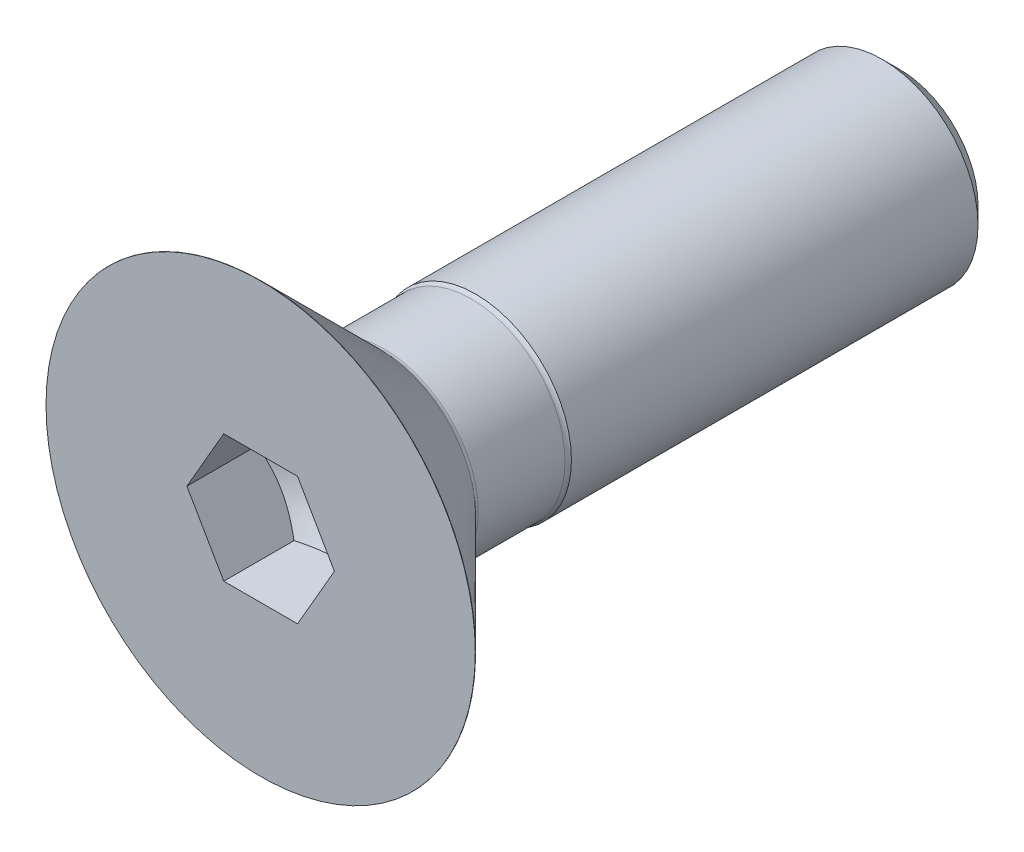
ISO-10303-21;
HEADER;
FILE_DESCRIPTION(('STEP AP214'),'2;1');
FILE_NAME('part.step','',(''),(''),'','','');
FILE_SCHEMA(('AUTOMOTIVE_DESIGN { 1 0 10303 214 1 1 1 1 }'));
ENDSEC;
DATA;
#1=APPLICATION_CONTEXT('core data for automotive mechanical design processes');
#2=APPLICATION_PROTOCOL_DEFINITION('international standard','automotive_design',2000,#1);
#3=PRODUCT_CONTEXT('',#1,'mechanical');
#4=PRODUCT('Part','Part','',(#3));
#5=PRODUCT_RELATED_PRODUCT_CATEGORY('part','',(#4));
#6=PRODUCT_DEFINITION_FORMATION('','',#4);
#7=PRODUCT_DEFINITION_CONTEXT('part definition',#1,'design');
#8=PRODUCT_DEFINITION('design','',#6,#7);
#9=PRODUCT_DEFINITION_SHAPE('','',#8);
#10=(LENGTH_UNIT() NAMED_UNIT(*) SI_UNIT(.MILLI.,.METRE.));
#11=(NAMED_UNIT(*) PLANE_ANGLE_UNIT() SI_UNIT($,.RADIAN.));
#12=(NAMED_UNIT(*) SI_UNIT($,.STERADIAN.) SOLID_ANGLE_UNIT());
#13=UNCERTAINTY_MEASURE_WITH_UNIT(LENGTH_MEASURE(1.E-05),#10,'distance_accuracy_value','');
#14=(GEOMETRIC_REPRESENTATION_CONTEXT(3) GLOBAL_UNCERTAINTY_ASSIGNED_CONTEXT((#13)) GLOBAL_UNIT_ASSIGNED_CONTEXT((#10,
#11,#12)) REPRESENTATION_CONTEXT('',''));
#15=CARTESIAN_POINT('',(0.,0.,0.));
#16=DIRECTION('',(0.,0.,1.));
#17=DIRECTION('',(1.,0.,0.));
#18=AXIS2_PLACEMENT_3D('',#15,#16,#17);
#19=CARTESIAN_POINT('',(0.,1.229375,-20.));
#20=DIRECTION('',(0.,0.,-1.));
#21=DIRECTION('',(-1.,0.,0.));
#22=AXIS2_PLACEMENT_3D('',#19,#20,#21);
#23=PLANE('',#22);
#24=CARTESIAN_POINT('',(0.,0.,-20.0000000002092));
#25=DIRECTION('',(0.,0.,1.));
#26=DIRECTION('',(1.,0.,0.));
#27=AXIS2_PLACEMENT_3D('',#24,#25,#26);
#28=CIRCLE('',#27,2.45875000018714);
#29=CARTESIAN_POINT('',(2.45875000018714,0.,-20.0000000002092));
#30=VERTEX_POINT('',#29);
#31=EDGE_CURVE('E20',#30,#30,#28,.T.);
#32=ORIENTED_EDGE('',*,*,#31,.F.);
#33=EDGE_LOOP('',(#32));
#34=FACE_BOUND('',#33,.T.);
#35=ADVANCED_FACE('F16',(#34),#23,.T.);
#36=CARTESIAN_POINT('',(0.,0.,-19.4587499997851));
#37=DIRECTION('',(0.,0.,1.));
#38=DIRECTION('',(1.,0.,0.));
#39=AXIS2_PLACEMENT_3D('',#36,#37,#38);
#40=CONICAL_SURFACE('',#39,2.99999999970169,0.785398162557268);
#41=ORIENTED_EDGE('',*,*,#31,.T.);
#42=EDGE_LOOP('',(#41));
#43=FACE_BOUND('',#42,.T.);
#44=CARTESIAN_POINT('',(0.,0.,-19.45875));
#45=DIRECTION('',(0.,0.,-1.));
#46=DIRECTION('',(-1.,0.,0.));
#47=AXIS2_PLACEMENT_3D('',#44,#45,#46);
#48=CIRCLE('',#47,3.);
#49=CARTESIAN_POINT('',(-3.,0.,-19.45875));
#50=VERTEX_POINT('',#49);
#51=EDGE_CURVE('E158',#50,#50,#48,.F.);
#52=ORIENTED_EDGE('',*,*,#51,.F.);
#53=EDGE_LOOP('',(#52));
#54=FACE_BOUND('',#53,.T.);
#55=ADVANCED_FACE('F238',(#43,#54),#40,.T.);
#56=CARTESIAN_POINT('',(0.,0.,-13.094375));
#57=DIRECTION('',(0.,0.,-1.));
#58=DIRECTION('',(-1.,0.,0.));
#59=AXIS2_PLACEMENT_3D('',#56,#57,#58);
#60=CYLINDRICAL_SURFACE('',#59,3.);
#61=ORIENTED_EDGE('',*,*,#51,.T.);
#62=EDGE_LOOP('',(#61));
#63=FACE_BOUND('',#62,.T.);
#64=CARTESIAN_POINT('',(0.,0.,-6.73));
#65=DIRECTION('',(0.,0.,1.));
#66=DIRECTION('',(0.,-1.,0.));
#67=AXIS2_PLACEMENT_3D('',#64,#65,#66);
#68=CIRCLE('',#67,3.);
#69=CARTESIAN_POINT('',(0.,-3.,-6.73));
#70=VERTEX_POINT('',#69);
#71=EDGE_CURVE('E155',#70,#70,#68,.T.);
#72=ORIENTED_EDGE('',*,*,#71,.F.);
#73=EDGE_LOOP('',(#72));
#74=FACE_BOUND('',#73,.T.);
#75=ADVANCED_FACE('F232',(#63,#74),#60,.T.);
#76=CARTESIAN_POINT('',(0.,0.,-6.58857864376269));
#77=DIRECTION('',(0.,0.,-1.));
#78=DIRECTION('',(0.,1.,0.));
#79=AXIS2_PLACEMENT_3D('',#76,#77,#78);
#80=TOROIDAL_SURFACE('',#79,3.14142135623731,0.200000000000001);
#81=ORIENTED_EDGE('',*,*,#71,.T.);
#82=EDGE_LOOP('',(#81));
#83=FACE_BOUND('',#82,.T.);
#84=CARTESIAN_POINT('',(0.,0.,-6.58857864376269));
#85=DIRECTION('',(0.,0.,-1.));
#86=DIRECTION('',(-1.,0.,0.));
#87=AXIS2_PLACEMENT_3D('',#84,#85,#86);
#88=CIRCLE('',#87,2.94142135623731);
#89=CARTESIAN_POINT('',(-2.94142135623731,0.,-6.58857864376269));
#90=VERTEX_POINT('',#89);
#91=EDGE_CURVE('E152',#90,#90,#88,.F.);
#92=ORIENTED_EDGE('',*,*,#91,.F.);
#93=EDGE_LOOP('',(#92));
#94=FACE_BOUND('',#93,.T.);
#95=ADVANCED_FACE('F230',(#83,#94),#80,.F.);
#96=CARTESIAN_POINT('',(0.,0.,-5.23));
#97=DIRECTION('',(0.,0.,-1.));
#98=DIRECTION('',(-1.,0.,0.));
#99=AXIS2_PLACEMENT_3D('',#96,#97,#98);
#100=CYLINDRICAL_SURFACE('',#99,2.94142135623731);
#101=CARTESIAN_POINT('',(0.,0.,-3.87142135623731));
#102=DIRECTION('',(0.,0.,1.));
#103=DIRECTION('',(0.,-1.,0.));
#104=AXIS2_PLACEMENT_3D('',#101,#102,#103);
#105=CIRCLE('',#104,2.94142135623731);
#106=CARTESIAN_POINT('',(0.,-2.94142135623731,-3.87142135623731));
#107=VERTEX_POINT('',#106);
#108=EDGE_CURVE('E149',#107,#107,#105,.T.);
#109=ORIENTED_EDGE('',*,*,#108,.F.);
#110=EDGE_LOOP('',(#109));
#111=FACE_BOUND('',#110,.T.);
#112=ORIENTED_EDGE('',*,*,#91,.T.);
#113=EDGE_LOOP('',(#112));
#114=FACE_BOUND('',#113,.T.);
#115=ADVANCED_FACE('F231',(#111,#114),#100,.T.);
#116=CARTESIAN_POINT('',(0.,0.,-3.87142135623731));
#117=DIRECTION('',(0.,0.,-1.));
#118=DIRECTION('',(0.,1.,0.));
#119=AXIS2_PLACEMENT_3D('',#116,#117,#118);
#120=TOROIDAL_SURFACE('',#119,3.14142135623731,0.200000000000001);
#121=CARTESIAN_POINT('',(0.,0.,-3.73000000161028));
#122=DIRECTION('',(0.,0.,1.));
#123=DIRECTION('',(0.,1.,0.));
#124=AXIS2_PLACEMENT_3D('',#121,#122,#123);
#125=CIRCLE('',#124,3.00000000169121);
#126=CARTESIAN_POINT('',(0.,3.00000000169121,-3.73000000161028));
#127=VERTEX_POINT('',#126);
#128=EDGE_CURVE('E146',#127,#127,#125,.T.);
#129=ORIENTED_EDGE('',*,*,#128,.F.);
#130=EDGE_LOOP('',(#129));
#131=FACE_BOUND('',#130,.T.);
#132=ORIENTED_EDGE('',*,*,#108,.T.);
#133=EDGE_LOOP('',(#132));
#134=FACE_BOUND('',#133,.T.);
#135=ADVANCED_FACE('F18',(#131,#134),#120,.F.);
#136=CARTESIAN_POINT('',(0.,0.,-0.00999999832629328));
#137=DIRECTION('',(0.,0.,1.));
#138=DIRECTION('',(1.,0.,0.));
#139=AXIS2_PLACEMENT_3D('',#136,#137,#138);
#140=CONICAL_SURFACE('',#139,6.71999999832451,0.78539816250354);
#141=ORIENTED_EDGE('',*,*,#128,.T.);
#142=EDGE_LOOP('',(#141));
#143=FACE_BOUND('',#142,.T.);
#144=CARTESIAN_POINT('',(0.,0.,-0.01));
#145=DIRECTION('',(0.,0.,-1.));
#146=DIRECTION('',(-1.,0.,0.));
#147=AXIS2_PLACEMENT_3D('',#144,#145,#146);
#148=CIRCLE('',#147,6.72);
#149=CARTESIAN_POINT('',(-6.72,0.,-0.0100000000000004));
#150=VERTEX_POINT('',#149);
#151=EDGE_CURVE('E80',#150,#150,#148,.F.);
#152=ORIENTED_EDGE('',*,*,#151,.F.);
#153=EDGE_LOOP('',(#152));
#154=FACE_BOUND('',#153,.T.);
#155=ADVANCED_FACE('F182',(#143,#154),#140,.T.);
#156=CARTESIAN_POINT('',(0.,0.,-2.19200000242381));
#157=DIRECTION('',(0.,0.,1.));
#158=DIRECTION('',(1.,0.,0.));
#159=AXIS2_PLACEMENT_3D('',#156,#157,#158);
#160=CONICAL_SURFACE('',#159,2.32325639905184,1.04719754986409);
#161=CARTESIAN_POINT('',(1.1546999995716,1.99999906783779,-2.19999999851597));
#162=CARTESIAN_POINT('',(1.05991057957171,1.99999906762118,-2.22736621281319));
#163=CARTESIAN_POINT('',(0.964371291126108,1.99999906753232,-2.25242075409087));
#164=CARTESIAN_POINT('',(0.771740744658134,1.99999906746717,-2.29670154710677));
#165=CARTESIAN_POINT('',(0.674646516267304,1.99999906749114,-2.315914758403));
#166=CARTESIAN_POINT('',(0.481547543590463,1.99999906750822,-2.34681192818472));
#167=CARTESIAN_POINT('',(0.385569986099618,1.99999906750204,-2.35866061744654));
#168=CARTESIAN_POINT('',(0.19306114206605,1.99999906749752,-2.37456678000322));
#169=CARTESIAN_POINT('',(0.0965305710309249,1.99999906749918,-2.37863271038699));
#170=CARTESIAN_POINT('',(-0.0965305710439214,1.99999906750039,-2.37863271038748));
#171=CARTESIAN_POINT('',(-0.193061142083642,1.99999906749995,-2.37456678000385));
#172=CARTESIAN_POINT('',(-0.38556998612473,1.99999906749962,-2.35866061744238));
#173=CARTESIAN_POINT('',(-0.481547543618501,1.99999906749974,-2.34681192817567));
#174=CARTESIAN_POINT('',(-0.674646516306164,1.99999906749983,-2.31591475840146));
#175=CARTESIAN_POINT('',(-0.771740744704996,1.99999906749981,-2.29670154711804));
#176=CARTESIAN_POINT('',(-0.964371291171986,1.99999906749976,-2.25242075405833));
#177=CARTESIAN_POINT('',(-1.05991057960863,1.99999906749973,-2.22736621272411));
#178=CARTESIAN_POINT('',(-1.15469999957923,1.99999906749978,-2.19999999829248));
#179=B_SPLINE_CURVE_WITH_KNOTS('',3,(#161,#162,#163,#164,#165,#166,#167,#168,#169,#170,#171,
#172,#173,#174,#175,#176,#177,#178),.UNSPECIFIED.,.F.,.F.,(4,2,2,2,2,2,2,2,4),(0.,
0.296073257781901,0.592802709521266,0.882630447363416,1.17214306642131,1.46165568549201,
1.75148342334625,2.048212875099,2.34428613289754),.UNSPECIFIED.);
#180=CARTESIAN_POINT('',(1.15469999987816,1.99999906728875,-2.1999999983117));
#181=VERTEX_POINT('',#180);
#182=CARTESIAN_POINT('',(-1.15469999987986,1.99999906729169,-2.19999999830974));
#183=VERTEX_POINT('',#182);
#184=EDGE_CURVE('E105',#181,#183,#179,.T.);
#185=ORIENTED_EDGE('',*,*,#184,.T.);
#186=CARTESIAN_POINT('',(-1.15470000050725,1.99999906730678,-2.1999999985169));
#187=CARTESIAN_POINT('',(-1.20544207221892,1.91211122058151,-2.22930443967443));
#188=CARTESIAN_POINT('',(-1.25662214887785,1.82346472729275,-2.25595529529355));
#189=CARTESIAN_POINT('',(-1.35986845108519,1.64463688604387,-2.30247356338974));
#190=CARTESIAN_POINT('',(-1.41193651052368,1.55445236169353,-2.32232452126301));
#191=CARTESIAN_POINT('',(-1.51542737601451,1.37520092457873,-2.35322396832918));
#192=CARTESIAN_POINT('',(-1.56683426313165,1.28616158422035,-2.36447813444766));
#193=CARTESIAN_POINT('',(-1.66988979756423,1.10766416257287,-2.37791074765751));
#194=CARTESIAN_POINT('',(-1.72153807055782,1.01820672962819,-2.38010032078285));
#195=CARTESIAN_POINT('',(-1.81803732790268,0.851065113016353,-2.37553362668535));
#196=CARTESIAN_POINT('',(-1.8629027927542,0.773355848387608,-2.36989863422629));
#197=CARTESIAN_POINT('',(-1.9523414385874,0.61844356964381,-2.35204262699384));
#198=CARTESIAN_POINT('',(-1.99691431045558,0.541241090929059,-2.33981551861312));
#199=CARTESIAN_POINT('',(-2.08653720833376,0.386009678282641,-2.30925011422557));
#200=CARTESIAN_POINT('',(-2.13157589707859,0.30800038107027,-2.29078231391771));
#201=CARTESIAN_POINT('',(-2.22098171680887,0.153144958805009,-2.24886821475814));
#202=CARTESIAN_POINT('',(-2.26534999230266,0.076296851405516,-2.22543175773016));
#203=CARTESIAN_POINT('',(-2.30939999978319,3.75516597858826E-10,-2.19999999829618));
#204=B_SPLINE_CURVE_WITH_KNOTS('',3,(#186,#187,#188,#189,#190,#191,#192,#193,#194,#195,#196,
#197,#198,#199,#200,#201,#202,#203),.UNSPECIFIED.,.F.,.F.,(4,2,2,2,2,2,2,2,4),(0.,
0.31701586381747,0.634793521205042,0.944707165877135,1.25424030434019,1.52370707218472,
1.79342335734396,2.06912065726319,2.34427687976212),.UNSPECIFIED.);
#205=CARTESIAN_POINT('',(-2.30939999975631,0.,-2.1999999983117));
#206=VERTEX_POINT('',#205);
#207=EDGE_CURVE('E87',#183,#206,#204,.T.);
#208=ORIENTED_EDGE('',*,*,#207,.T.);
#209=CARTESIAN_POINT('',(-2.30940000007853,-5.40012364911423E-10,-2.19999999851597));
#210=CARTESIAN_POINT('',(-2.25865792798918,-0.0878878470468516,-2.22930443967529));
#211=CARTESIAN_POINT('',(-2.20747785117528,-0.176534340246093,-2.25595529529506));
#212=CARTESIAN_POINT('',(-2.10423154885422,-0.355362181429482,-2.30247356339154));
#213=CARTESIAN_POINT('',(-2.05216348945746,-0.44554670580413,-2.32232452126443));
#214=CARTESIAN_POINT('',(-1.94867262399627,-0.624798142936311,-2.35322396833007));
#215=CARTESIAN_POINT('',(-1.89726573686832,-0.713837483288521,-2.36447813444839));
#216=CARTESIAN_POINT('',(-1.79421020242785,-0.892334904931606,-2.37791074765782));
#217=CARTESIAN_POINT('',(-1.74256192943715,-0.981792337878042,-2.38010032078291));
#218=CARTESIAN_POINT('',(-1.64606267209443,-1.1489339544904,-2.37553362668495));
#219=CARTESIAN_POINT('',(-1.60119720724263,-1.22664321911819,-2.36989863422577));
#220=CARTESIAN_POINT('',(-1.51175856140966,-1.38155549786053,-2.35204262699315));
#221=CARTESIAN_POINT('',(-1.467185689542,-1.45875797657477,-2.3398155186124));
#222=CARTESIAN_POINT('',(-1.37756279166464,-1.61398938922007,-2.30925011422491));
#223=CARTESIAN_POINT('',(-1.33252410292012,-1.69199868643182,-2.29078231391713));
#224=CARTESIAN_POINT('',(-1.24311828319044,-1.84685410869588,-2.2488682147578));
#225=CARTESIAN_POINT('',(-1.19875000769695,-1.92370221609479,-2.22543175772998));
#226=CARTESIAN_POINT('',(-1.15470000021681,-1.99999906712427,-2.19999999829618));
#227=B_SPLINE_CURVE_WITH_KNOTS('',3,(#209,#210,#211,#212,#213,#214,#215,#216,#217,#218,#219,
#220,#221,#222,#223,#224,#225,#226),.UNSPECIFIED.,.F.,.F.,(4,2,2,2,2,2,2,2,4),(0.,
0.317015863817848,0.634793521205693,0.94470716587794,1.25424030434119,1.5237070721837,
1.79342335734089,2.06912065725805,2.34427687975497),.UNSPECIFIED.);
#228=CARTESIAN_POINT('',(-1.15469999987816,-1.99999906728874,-2.1999999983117));
#229=VERTEX_POINT('',#228);
#230=EDGE_CURVE('E82',#206,#229,#227,.T.);
#231=ORIENTED_EDGE('',*,*,#230,.T.);
#232=CARTESIAN_POINT('',(-1.1546999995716,-1.99999906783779,-2.19999999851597));
#233=CARTESIAN_POINT('',(-1.05991057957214,-1.999999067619,-2.2273662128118));
#234=CARTESIAN_POINT('',(-0.964371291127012,-1.99999906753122,-2.25242075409));
#235=CARTESIAN_POINT('',(-0.771740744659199,-1.99999906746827,-2.29670154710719));
#236=CARTESIAN_POINT('',(-0.674646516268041,-1.99999906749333,-2.31591475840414));
#237=CARTESIAN_POINT('',(-0.481547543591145,-1.99999906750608,-2.34681192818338));
#238=CARTESIAN_POINT('',(-0.385569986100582,-1.99999906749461,-2.35866061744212));
#239=CARTESIAN_POINT('',(-0.193061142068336,-1.99999906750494,-2.37456678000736));
#240=CARTESIAN_POINT('',(-0.0965305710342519,-1.99999906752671,-2.37863271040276));
#241=CARTESIAN_POINT('',(0.0965305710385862,-1.99999906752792,-2.3786327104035));
#242=CARTESIAN_POINT('',(0.19306114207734,-1.99999906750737,-2.37456678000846));
#243=CARTESIAN_POINT('',(0.385569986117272,-1.99999906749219,-2.35866061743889));
#244=CARTESIAN_POINT('',(0.481547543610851,-1.99999906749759,-2.34681192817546));
#245=CARTESIAN_POINT('',(0.674646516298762,-1.99999906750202,-2.31591475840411));
#246=CARTESIAN_POINT('',(0.771740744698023,-1.9999990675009,-2.29670154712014));
#247=CARTESIAN_POINT('',(0.964371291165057,-1.99999906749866,-2.25242075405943));
#248=CARTESIAN_POINT('',(1.05991057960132,-1.99999906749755,-2.22736621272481));
#249=CARTESIAN_POINT('',(1.1546999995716,-1.99999906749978,-2.19999999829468));
#250=B_SPLINE_CURVE_WITH_KNOTS('',3,(#232,#233,#234,#235,#236,#237,#238,#239,#240,#241,#242,
#243,#244,#245,#246,#247,#248,#249),.UNSPECIFIED.,.F.,.F.,(4,2,2,2,2,2,2,2,4),(0.,
0.296073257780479,0.592802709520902,0.882630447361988,1.17214306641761,1.46165568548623,
1.7514834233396,2.0482128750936,2.34428613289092),.UNSPECIFIED.);
#251=CARTESIAN_POINT('',(1.15469999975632,-1.99999906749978,-2.19999999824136));
#252=VERTEX_POINT('',#251);
#253=EDGE_CURVE('E68',#229,#252,#250,.T.);
#254=ORIENTED_EDGE('',*,*,#253,.T.);
#255=CARTESIAN_POINT('',(1.15470000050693,-1.99999906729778,-2.19999999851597));
#256=CARTESIAN_POINT('',(1.20544207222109,-1.91211122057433,-2.22930443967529));
#257=CARTESIAN_POINT('',(1.25662214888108,-1.82346472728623,-2.25595529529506));
#258=CARTESIAN_POINT('',(1.35986845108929,-1.64463688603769,-2.30247356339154));
#259=CARTESIAN_POINT('',(1.41193651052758,-1.55445236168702,-2.32232452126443));
#260=CARTESIAN_POINT('',(1.51542737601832,-1.37520092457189,-2.35322396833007));
#261=CARTESIAN_POINT('',(1.56683426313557,-1.28616158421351,-2.36447813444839));
#262=CARTESIAN_POINT('',(1.66988979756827,-1.10766416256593,-2.37791074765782));
#263=CARTESIAN_POINT('',(1.72153807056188,-1.01820672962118,-2.38010032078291));
#264=CARTESIAN_POINT('',(1.81803732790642,-0.851065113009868,-2.37553362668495));
#265=CARTESIAN_POINT('',(1.86290279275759,-0.773355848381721,-2.36989863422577));
#266=CARTESIAN_POINT('',(1.95234143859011,-0.618443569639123,-2.35204262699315));
#267=CARTESIAN_POINT('',(1.99691431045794,-0.541241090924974,-2.3398155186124));
#268=CARTESIAN_POINT('',(2.08653720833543,-0.386009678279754,-2.30925011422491));
#269=CARTESIAN_POINT('',(2.13157589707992,-0.308000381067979,-2.29078231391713));
#270=CARTESIAN_POINT('',(2.22098171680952,-0.153144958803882,-2.2488682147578));
#271=CARTESIAN_POINT('',(2.26534999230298,-0.0762968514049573,-2.22543175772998));
#272=CARTESIAN_POINT('',(2.30939999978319,-3.75516997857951E-10,-2.19999999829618));
#273=B_SPLINE_CURVE_WITH_KNOTS('',3,(#255,#256,#257,#258,#259,#260,#261,#262,#263,#264,#265,
#266,#267,#268,#269,#270,#271,#272),.UNSPECIFIED.,.F.,.F.,(4,2,2,2,2,2,2,2,4),(0.,
0.317015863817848,0.634793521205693,0.94470716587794,1.25424030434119,1.5237070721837,
1.79342335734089,2.06912065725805,2.34427687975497),.UNSPECIFIED.);
#274=CARTESIAN_POINT('',(2.30939999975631,0.,-2.1999999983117));
#275=VERTEX_POINT('',#274);
#276=EDGE_CURVE('E114',#252,#275,#273,.T.);
#277=ORIENTED_EDGE('',*,*,#276,.T.);
#278=CARTESIAN_POINT('',(2.30940000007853,5.40012593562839E-10,-2.19999999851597));
#279=CARTESIAN_POINT('',(2.25865792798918,0.0878878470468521,-2.22930443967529));
#280=CARTESIAN_POINT('',(2.20747785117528,0.176534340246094,-2.25595529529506));
#281=CARTESIAN_POINT('',(2.10423154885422,0.355362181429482,-2.30247356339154));
#282=CARTESIAN_POINT('',(2.05216348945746,0.445546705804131,-2.32232452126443));
#283=CARTESIAN_POINT('',(1.94867262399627,0.624798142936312,-2.35322396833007));
#284=CARTESIAN_POINT('',(1.89726573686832,0.713837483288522,-2.36447813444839));
#285=CARTESIAN_POINT('',(1.79421020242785,0.892334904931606,-2.37791074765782));
#286=CARTESIAN_POINT('',(1.74256192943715,0.981792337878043,-2.38010032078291));
#287=CARTESIAN_POINT('',(1.64606267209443,1.1489339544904,-2.37553362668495));
#288=CARTESIAN_POINT('',(1.60119720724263,1.22664321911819,-2.36989863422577));
#289=CARTESIAN_POINT('',(1.51175856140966,1.38155549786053,-2.35204262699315));
#290=CARTESIAN_POINT('',(1.467185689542,1.45875797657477,-2.3398155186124));
#291=CARTESIAN_POINT('',(1.37756279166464,1.61398938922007,-2.30925011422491));
#292=CARTESIAN_POINT('',(1.33252410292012,1.69199868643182,-2.29078231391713));
#293=CARTESIAN_POINT('',(1.24311828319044,1.84685410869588,-2.2488682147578));
#294=CARTESIAN_POINT('',(1.19875000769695,1.92370221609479,-2.22543175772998));
#295=CARTESIAN_POINT('',(1.15470000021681,1.99999906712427,-2.19999999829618));
#296=B_SPLINE_CURVE_WITH_KNOTS('',3,(#278,#279,#280,#281,#282,#283,#284,#285,#286,#287,#288,
#289,#290,#291,#292,#293,#294,#295),.UNSPECIFIED.,.F.,.F.,(4,2,2,2,2,2,2,2,4),(0.,
0.317015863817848,0.634793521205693,0.94470716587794,1.25424030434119,1.5237070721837,
1.79342335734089,2.06912065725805,2.34427687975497),.UNSPECIFIED.);
#297=EDGE_CURVE('E110',#275,#181,#296,.T.);
#298=ORIENTED_EDGE('',*,*,#297,.T.);
#299=EDGE_LOOP('',(#185,#208,#231,#254,#277,#298));
#300=FACE_BOUND('',#299,.T.);
#301=CARTESIAN_POINT('',(0.,2.55795384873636E-10,-3.53333271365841));
#302=VERTEX_POINT('',#301);
#303=VERTEX_LOOP('',#302);
#304=FACE_BOUND('',#303,.T.);
#305=ADVANCED_FACE('F84',(#300,#304),#160,.F.);
#306=CARTESIAN_POINT('',(0.,0.,-0.005));
#307=DIRECTION('',(0.,0.,-1.));
#308=DIRECTION('',(-1.,0.,0.));
#309=AXIS2_PLACEMENT_3D('',#306,#307,#308);
#310=CYLINDRICAL_SURFACE('',#309,6.72);
#311=ORIENTED_EDGE('',*,*,#151,.T.);
#312=EDGE_LOOP('',(#311));
#313=FACE_BOUND('',#312,.T.);
#314=CARTESIAN_POINT('',(0.,0.,0.));
#315=DIRECTION('',(0.,0.,-1.));
#316=DIRECTION('',(-1.,0.,0.));
#317=AXIS2_PLACEMENT_3D('',#314,#315,#316);
#318=CIRCLE('',#317,6.72);
#319=CARTESIAN_POINT('',(-6.72,0.,0.));
#320=VERTEX_POINT('',#319);
#321=EDGE_CURVE('E122',#320,#320,#318,.F.);
#322=ORIENTED_EDGE('',*,*,#321,.F.);
#323=EDGE_LOOP('',(#322));
#324=FACE_BOUND('',#323,.T.);
#325=ADVANCED_FACE('F181',(#313,#324),#310,.T.);
#326=CARTESIAN_POINT('',(-1.1547,-1.99999906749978,0.));
#327=DIRECTION('',(0.,-1.,0.));
#328=DIRECTION('',(0.,0.,-1.));
#329=AXIS2_PLACEMENT_3D('',#326,#327,#328);
#330=PLANE('',#329);
#331=ORIENTED_EDGE('',*,*,#253,.F.);
#332=DIRECTION('',(0.,0.,1.));
#333=VECTOR('',#332,1.);
#334=CARTESIAN_POINT('',(-1.1547,-1.99999906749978,0.));
#335=LINE('',#334,#333);
#336=CARTESIAN_POINT('',(-1.1547,-1.99999906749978,0.));
#337=VERTEX_POINT('',#336);
#338=EDGE_CURVE('E73',#229,#337,#335,.T.);
#339=ORIENTED_EDGE('',*,*,#338,.T.);
#340=DIRECTION('',(1.,0.,0.));
#341=VECTOR('',#340,1.);
#342=CARTESIAN_POINT('',(0.,-1.99999906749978,0.));
#343=LINE('',#342,#341);
#344=CARTESIAN_POINT('',(1.1547,-1.99999906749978,0.));
#345=VERTEX_POINT('',#344);
#346=EDGE_CURVE('E120',#345,#337,#343,.F.);
#347=ORIENTED_EDGE('',*,*,#346,.F.);
#348=DIRECTION('',(0.,0.,1.));
#349=VECTOR('',#348,1.);
#350=CARTESIAN_POINT('',(1.1547,-1.99999906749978,0.));
#351=LINE('',#350,#349);
#352=EDGE_CURVE('E76',#345,#252,#351,.F.);
#353=ORIENTED_EDGE('',*,*,#352,.T.);
#354=EDGE_LOOP('',(#331,#339,#347,#353));
#355=FACE_BOUND('',#354,.T.);
#356=ADVANCED_FACE('F70',(#355),#330,.F.);
#357=CARTESIAN_POINT('',(-2.3094,0.,0.));
#358=DIRECTION('',(-0.866025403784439,-0.5,0.));
#359=DIRECTION('',(0.5,-0.866025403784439,0.));
#360=AXIS2_PLACEMENT_3D('',#357,#358,#359);
#361=PLANE('',#360);
#362=DIRECTION('',(0.,0.,1.));
#363=VECTOR('',#362,1.);
#364=CARTESIAN_POINT('',(-2.3094,0.,0.));
#365=LINE('',#364,#363);
#366=CARTESIAN_POINT('',(-2.3094,0.,0.));
#367=VERTEX_POINT('',#366);
#368=EDGE_CURVE('E90',#206,#367,#365,.T.);
#369=ORIENTED_EDGE('',*,*,#368,.T.);
#370=DIRECTION('',(-0.5,0.866025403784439,0.));
#371=VECTOR('',#370,1.);
#372=CARTESIAN_POINT('',(-1.1547,-1.99999906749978,0.));
#373=LINE('',#372,#371);
#374=EDGE_CURVE('E94',#337,#367,#373,.T.);
#375=ORIENTED_EDGE('',*,*,#374,.F.);
#376=ORIENTED_EDGE('',*,*,#338,.F.);
#377=ORIENTED_EDGE('',*,*,#230,.F.);
#378=EDGE_LOOP('',(#369,#375,#376,#377));
#379=FACE_BOUND('',#378,.T.);
#380=ADVANCED_FACE('F92',(#379),#361,.F.);
#381=CARTESIAN_POINT('',(-1.1547,1.99999906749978,0.));
#382=DIRECTION('',(-0.866025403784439,0.5,0.));
#383=DIRECTION('',(-0.5,-0.866025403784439,0.));
#384=AXIS2_PLACEMENT_3D('',#381,#382,#383);
#385=PLANE('',#384);
#386=DIRECTION('',(0.,0.,1.));
#387=VECTOR('',#386,1.);
#388=CARTESIAN_POINT('',(-1.1547,1.99999906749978,0.));
#389=LINE('',#388,#387);
#390=CARTESIAN_POINT('',(-1.1547,1.99999906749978,0.));
#391=VERTEX_POINT('',#390);
#392=EDGE_CURVE('E103',#183,#391,#389,.T.);
#393=ORIENTED_EDGE('',*,*,#392,.T.);
#394=DIRECTION('',(0.5,0.866025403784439,0.));
#395=VECTOR('',#394,1.);
#396=CARTESIAN_POINT('',(-2.3094,0.,0.));
#397=LINE('',#396,#395);
#398=EDGE_CURVE('E134',#367,#391,#397,.T.);
#399=ORIENTED_EDGE('',*,*,#398,.F.);
#400=ORIENTED_EDGE('',*,*,#368,.F.);
#401=ORIENTED_EDGE('',*,*,#207,.F.);
#402=EDGE_LOOP('',(#393,#399,#400,#401));
#403=FACE_BOUND('',#402,.T.);
#404=ADVANCED_FACE('F208',(#403),#385,.F.);
#405=CARTESIAN_POINT('',(1.1547,1.99999906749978,0.));
#406=DIRECTION('',(0.,1.,0.));
#407=DIRECTION('',(0.,0.,1.));
#408=AXIS2_PLACEMENT_3D('',#405,#406,#407);
#409=PLANE('',#408);
#410=ORIENTED_EDGE('',*,*,#184,.F.);
#411=DIRECTION('',(0.,0.,1.));
#412=VECTOR('',#411,1.);
#413=CARTESIAN_POINT('',(1.1547,1.99999906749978,0.));
#414=LINE('',#413,#412);
#415=CARTESIAN_POINT('',(1.1547,1.99999906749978,0.));
#416=VERTEX_POINT('',#415);
#417=EDGE_CURVE('E108',#181,#416,#414,.T.);
#418=ORIENTED_EDGE('',*,*,#417,.T.);
#419=DIRECTION('',(1.,0.,0.));
#420=VECTOR('',#419,1.);
#421=CARTESIAN_POINT('',(0.,1.99999906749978,0.));
#422=LINE('',#421,#420);
#423=EDGE_CURVE('E129',#391,#416,#422,.T.);
#424=ORIENTED_EDGE('',*,*,#423,.F.);
#425=ORIENTED_EDGE('',*,*,#392,.F.);
#426=EDGE_LOOP('',(#410,#418,#424,#425));
#427=FACE_BOUND('',#426,.T.);
#428=ADVANCED_FACE('F212',(#427),#409,.F.);
#429=CARTESIAN_POINT('',(2.3094,0.,0.));
#430=DIRECTION('',(0.866025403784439,0.5,0.));
#431=DIRECTION('',(-0.5,0.866025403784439,0.));
#432=AXIS2_PLACEMENT_3D('',#429,#430,#431);
#433=PLANE('',#432);
#434=DIRECTION('',(0.,0.,1.));
#435=VECTOR('',#434,1.);
#436=CARTESIAN_POINT('',(2.3094,0.,0.));
#437=LINE('',#436,#435);
#438=CARTESIAN_POINT('',(2.3094,0.,0.));
#439=VERTEX_POINT('',#438);
#440=EDGE_CURVE('E35',#275,#439,#437,.T.);
#441=ORIENTED_EDGE('',*,*,#440,.T.);
#442=DIRECTION('',(0.5,-0.866025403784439,0.));
#443=VECTOR('',#442,1.);
#444=CARTESIAN_POINT('',(1.1547,1.99999906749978,0.));
#445=LINE('',#444,#443);
#446=EDGE_CURVE('E26',#416,#439,#445,.T.);
#447=ORIENTED_EDGE('',*,*,#446,.F.);
#448=ORIENTED_EDGE('',*,*,#417,.F.);
#449=ORIENTED_EDGE('',*,*,#297,.F.);
#450=EDGE_LOOP('',(#441,#447,#448,#449));
#451=FACE_BOUND('',#450,.T.);
#452=ADVANCED_FACE('F216',(#451),#433,.F.);
#453=CARTESIAN_POINT('',(1.1547,-1.99999906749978,0.));
#454=DIRECTION('',(0.866025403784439,-0.5,0.));
#455=DIRECTION('',(0.5,0.866025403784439,0.));
#456=AXIS2_PLACEMENT_3D('',#453,#454,#455);
#457=PLANE('',#456);
#458=ORIENTED_EDGE('',*,*,#352,.F.);
#459=DIRECTION('',(-0.5,-0.866025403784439,0.));
#460=VECTOR('',#459,1.);
#461=CARTESIAN_POINT('',(2.3094,0.,0.));
#462=LINE('',#461,#460);
#463=EDGE_CURVE('E10',#439,#345,#462,.T.);
#464=ORIENTED_EDGE('',*,*,#463,.F.);
#465=ORIENTED_EDGE('',*,*,#440,.F.);
#466=ORIENTED_EDGE('',*,*,#276,.F.);
#467=EDGE_LOOP('',(#458,#464,#465,#466));
#468=FACE_BOUND('',#467,.T.);
#469=ADVANCED_FACE('F174',(#468),#457,.F.);
#470=CARTESIAN_POINT('',(0.,3.36,0.));
#471=DIRECTION('',(0.,0.,1.));
#472=DIRECTION('',(1.,0.,0.));
#473=AXIS2_PLACEMENT_3D('',#470,#471,#472);
#474=PLANE('',#473);
#475=ORIENTED_EDGE('',*,*,#446,.T.);
#476=ORIENTED_EDGE('',*,*,#463,.T.);
#477=ORIENTED_EDGE('',*,*,#346,.T.);
#478=ORIENTED_EDGE('',*,*,#374,.T.);
#479=ORIENTED_EDGE('',*,*,#398,.T.);
#480=ORIENTED_EDGE('',*,*,#423,.T.);
#481=EDGE_LOOP('',(#475,#476,#477,#478,#479,#480));
#482=FACE_BOUND('',#481,.T.);
#483=ORIENTED_EDGE('',*,*,#321,.T.);
#484=EDGE_LOOP('',(#483));
#485=FACE_BOUND('',#484,.T.);
#486=ADVANCED_FACE('F223',(#482,#485),#474,.T.);
#487=CLOSED_SHELL('',(#35,#55,#75,#95,#115,#135,#155,#305,#325,#356,#380,#404,#428,#452,#469,#486));
#488=MANIFOLD_SOLID_BREP('B1',#487);
#489=ADVANCED_BREP_SHAPE_REPRESENTATION('',(#18,#488),#14);
#490=SHAPE_DEFINITION_REPRESENTATION(#9,#489);
ENDSEC;
END-ISO-10303-21;
